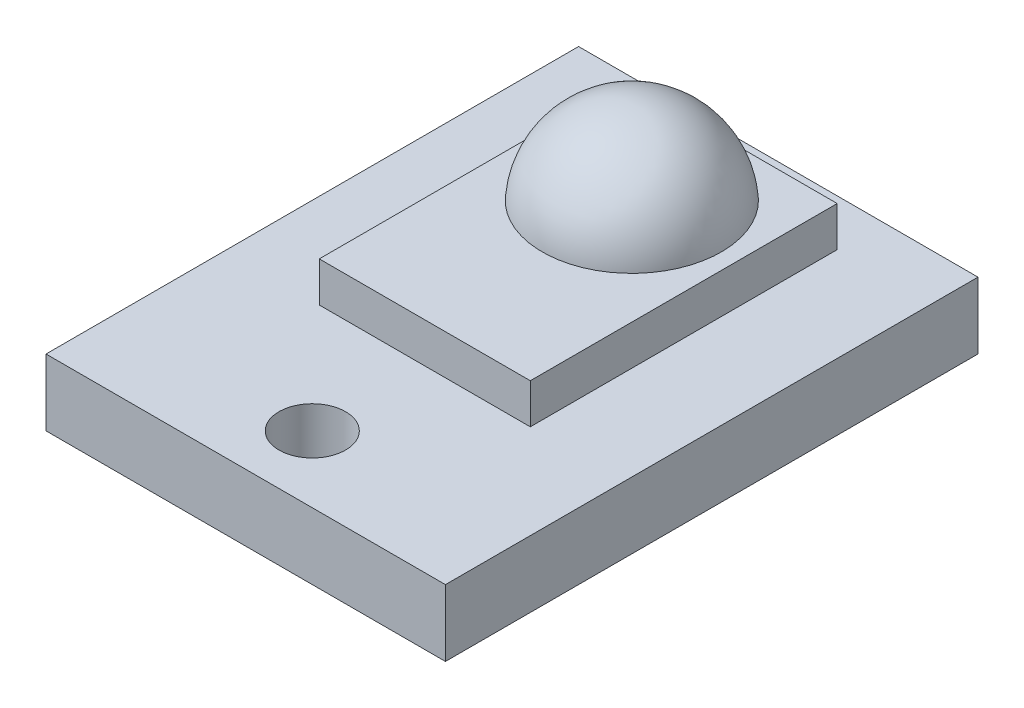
from build123d import *

# Parameters (mm, degrees)
SKETCH1_W           = 6
SKETCH1_H           = 8
BOSS_EXTRUDE1_DEPTH = 1
SKETCH2_R           = 1.34535926
BOSS_EXTRUDE2_DEPTH = 0.6
DOME1_FACE_RADIUS   = 1.34535926
DOME1_HEIGHT        = 1.25
SKETCH4_W           = 3.17
SKETCH4_H           = 4.61
BOSS_EXTRUDE3_DEPTH = 0.6
SKETCH5_R           = 0.5
CUT_EXTRUDE1_DEPTH  = 6.331275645


with BuildPart() as part:
    # Sketch1 → Boss-Extrude1 (new body)
    with BuildSketch(Plane(origin=(0, 0, 0), x_dir=(1, 0, 0), z_dir=(0, 1, 0))):
        Rectangle(SKETCH1_W, SKETCH1_H)
    extrude(amount=BOSS_EXTRUDE1_DEPTH)

    # Sketch2 → Boss-Extrude2 (add)
    with BuildSketch(Plane(origin=(0, 1, 0), x_dir=(1, 0, 0), z_dir=(0, 1, 0))):
        with Locations(Location((0, 1.8, 0), (0, 0, 90))):
            Circle(SKETCH2_R)
    extrude(amount=BOSS_EXTRUDE2_DEPTH)

    # Dome1: a dome of height H over a round flat face of radius A is a cap of a sphere of radius (A * A + H * H) / (2 * H)
    dome1_r = (DOME1_FACE_RADIUS * DOME1_FACE_RADIUS + DOME1_HEIGHT * DOME1_HEIGHT) / (2 * DOME1_HEIGHT)
    dome1_base = Plane((0, 1.6, -1.8), z_dir=(0, 1, 0))
    with Locations(dome1_base.offset(DOME1_HEIGHT - dome1_r)):
        dome1_ball = Sphere(dome1_r, mode=Mode.PRIVATE)
    add(split(dome1_ball, bisect_by=dome1_base, keep=Keep.TOP, mode=Mode.PRIVATE))

    # Sketch4 → Boss-Extrude3 (add)
    with BuildSketch(Plane(origin=(0, 1, 0), x_dir=(1, 0, 0), z_dir=(0, 1, 0))):
        with Locations((0, 0.995)):
            Rectangle(SKETCH4_W, SKETCH4_H)
    extrude(amount=BOSS_EXTRUDE3_DEPTH)

    # Sketch5 → Cut-Extrude1 (cut, through all)
    with BuildSketch(Plane(origin=(0, 1, 0), x_dir=(1, 0, 0), z_dir=(0, 1, 0))):
        with Locations(Location((0, -3, 0), (0, 0, 270))):
            Circle(SKETCH5_R)
    extrude(amount=-CUT_EXTRUDE1_DEPTH, mode=Mode.SUBTRACT)


solid = part.part
